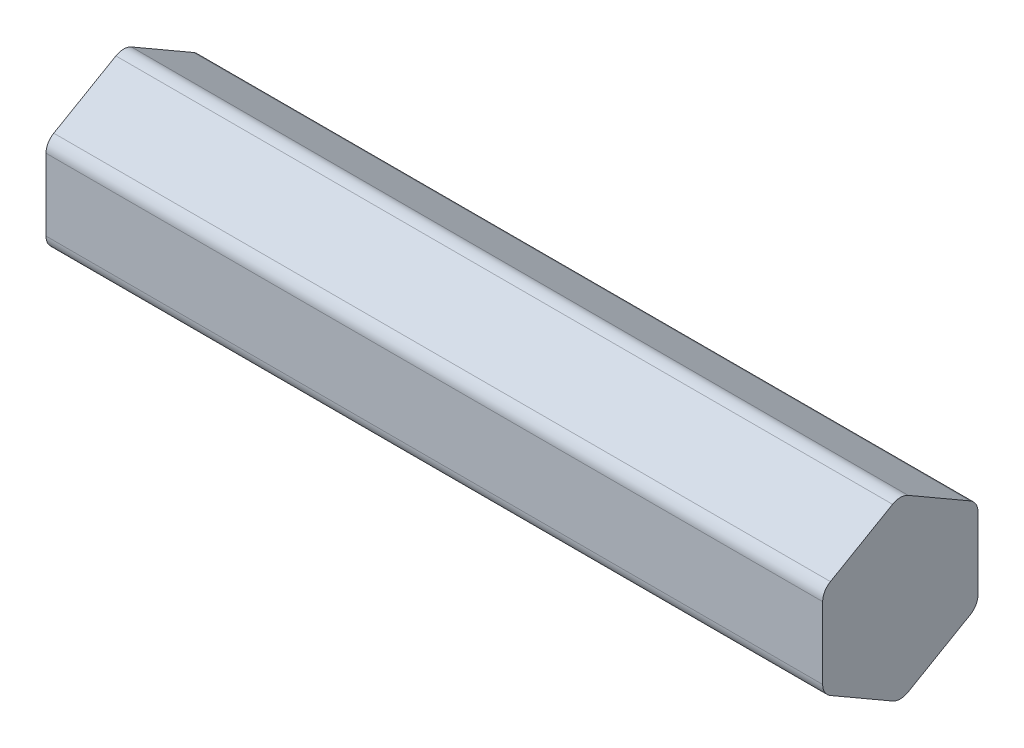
from build123d import *

# Parameters (mm, degrees)
BASE_DEPTH = 50
FILLET1_R  = 1


with BuildPart() as part:
    # Sketch1 → Base (new body)
    with BuildSketch(Plane(origin=(0, 0, 0), x_dir=(0, 0, -1), z_dir=(1, 0, 0))):
        Polygon((0, 5.773502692), (-5, 2.886751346), (-5, -2.886751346), (0, -5.773502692), (5, -2.886751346), (5, 2.886751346), align=None)
    extrude(amount=BASE_DEPTH)

    # Fillet1
    fillet1_edges = [part.edges().sort_by_distance(p)[0] for p in [
        (25, 2.886751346, -5),
        (25, -2.886751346, -5),
        (25, -5.773502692, 0),
        (25, -2.886751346, 5),
        (25, 2.886751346, 5),
        (25, 5.773502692, 0),
    ]]
    fillet(fillet1_edges, radius=FILLET1_R)


solid = part.part
